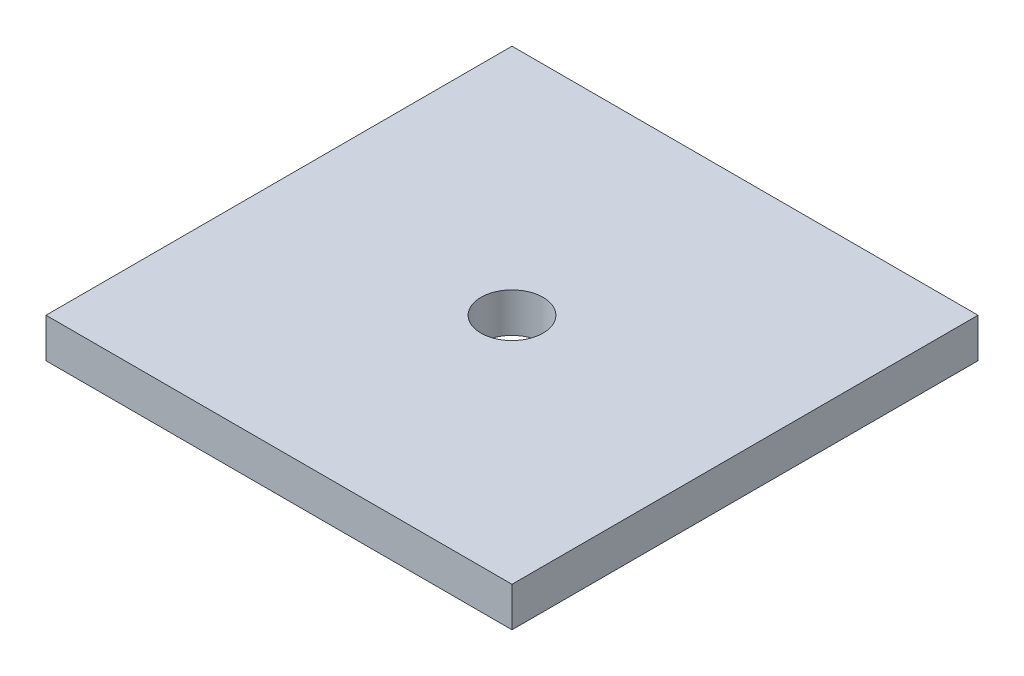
ISO-10303-21;
HEADER;
FILE_DESCRIPTION(('STEP AP214'),'2;1');
FILE_NAME('part.step','',(''),(''),'','','');
FILE_SCHEMA(('AUTOMOTIVE_DESIGN { 1 0 10303 214 1 1 1 1 }'));
ENDSEC;
DATA;
#1=APPLICATION_CONTEXT('core data for automotive mechanical design processes');
#2=APPLICATION_PROTOCOL_DEFINITION('international standard','automotive_design',2000,#1);
#3=PRODUCT_CONTEXT('',#1,'mechanical');
#4=PRODUCT('Part','Part','',(#3));
#5=PRODUCT_RELATED_PRODUCT_CATEGORY('part','',(#4));
#6=PRODUCT_DEFINITION_FORMATION('','',#4);
#7=PRODUCT_DEFINITION_CONTEXT('part definition',#1,'design');
#8=PRODUCT_DEFINITION('design','',#6,#7);
#9=PRODUCT_DEFINITION_SHAPE('','',#8);
#10=(LENGTH_UNIT() NAMED_UNIT(*) SI_UNIT(.MILLI.,.METRE.));
#11=(NAMED_UNIT(*) PLANE_ANGLE_UNIT() SI_UNIT($,.RADIAN.));
#12=(NAMED_UNIT(*) SI_UNIT($,.STERADIAN.) SOLID_ANGLE_UNIT());
#13=UNCERTAINTY_MEASURE_WITH_UNIT(LENGTH_MEASURE(1.E-05),#10,'distance_accuracy_value','');
#14=(GEOMETRIC_REPRESENTATION_CONTEXT(3) GLOBAL_UNCERTAINTY_ASSIGNED_CONTEXT((#13)) GLOBAL_UNIT_ASSIGNED_CONTEXT((#10,
#11,#12)) REPRESENTATION_CONTEXT('',''));
#15=CARTESIAN_POINT('',(0.,0.,0.));
#16=DIRECTION('',(0.,0.,1.));
#17=DIRECTION('',(1.,0.,0.));
#18=AXIS2_PLACEMENT_3D('',#15,#16,#17);
#19=CARTESIAN_POINT('',(37.5,6.35,-37.5));
#20=DIRECTION('',(-1.,0.,0.));
#21=DIRECTION('',(0.,0.,1.));
#22=AXIS2_PLACEMENT_3D('',#19,#20,#21);
#23=PLANE('',#22);
#24=DIRECTION('',(0.,0.,-1.));
#25=VECTOR('',#24,1.);
#26=CARTESIAN_POINT('',(37.5,0.,-37.5));
#27=LINE('',#26,#25);
#28=CARTESIAN_POINT('',(37.5,0.,37.5));
#29=VERTEX_POINT('',#28);
#30=CARTESIAN_POINT('',(37.5,0.,-37.5));
#31=VERTEX_POINT('',#30);
#32=EDGE_CURVE('E95',#29,#31,#27,.T.);
#33=ORIENTED_EDGE('',*,*,#32,.T.);
#34=DIRECTION('',(0.,-1.,0.));
#35=VECTOR('',#34,1.);
#36=CARTESIAN_POINT('',(37.5,6.35,-37.5));
#37=LINE('',#36,#35);
#38=CARTESIAN_POINT('',(37.5,6.35,-37.5));
#39=VERTEX_POINT('',#38);
#40=EDGE_CURVE('E11',#39,#31,#37,.T.);
#41=ORIENTED_EDGE('',*,*,#40,.F.);
#42=DIRECTION('',(0.,0.,-1.));
#43=VECTOR('',#42,1.);
#44=CARTESIAN_POINT('',(37.5,6.35,-37.5));
#45=LINE('',#44,#43);
#46=CARTESIAN_POINT('',(37.5,6.35,37.5));
#47=VERTEX_POINT('',#46);
#48=EDGE_CURVE('E83',#47,#39,#45,.T.);
#49=ORIENTED_EDGE('',*,*,#48,.F.);
#50=DIRECTION('',(0.,-1.,0.));
#51=VECTOR('',#50,1.);
#52=CARTESIAN_POINT('',(37.5,6.35,37.5));
#53=LINE('',#52,#51);
#54=EDGE_CURVE('E91',#47,#29,#53,.T.);
#55=ORIENTED_EDGE('',*,*,#54,.T.);
#56=EDGE_LOOP('',(#33,#41,#49,#55));
#57=FACE_BOUND('',#56,.T.);
#58=ADVANCED_FACE('F32',(#57),#23,.F.);
#59=CARTESIAN_POINT('',(-37.5,6.35,-37.5));
#60=DIRECTION('',(0.,0.,1.));
#61=DIRECTION('',(1.,0.,0.));
#62=AXIS2_PLACEMENT_3D('',#59,#60,#61);
#63=PLANE('',#62);
#64=DIRECTION('',(-1.,0.,0.));
#65=VECTOR('',#64,1.);
#66=CARTESIAN_POINT('',(-37.5,0.,-37.5));
#67=LINE('',#66,#65);
#68=CARTESIAN_POINT('',(-37.5,0.,-37.5));
#69=VERTEX_POINT('',#68);
#70=EDGE_CURVE('E87',#31,#69,#67,.T.);
#71=ORIENTED_EDGE('',*,*,#70,.T.);
#72=DIRECTION('',(0.,-1.,0.));
#73=VECTOR('',#72,1.);
#74=CARTESIAN_POINT('',(-37.5,6.35,-37.5));
#75=LINE('',#74,#73);
#76=CARTESIAN_POINT('',(-37.5,6.35,-37.5));
#77=VERTEX_POINT('',#76);
#78=EDGE_CURVE('E40',#77,#69,#75,.T.);
#79=ORIENTED_EDGE('',*,*,#78,.F.);
#80=DIRECTION('',(-1.,0.,0.));
#81=VECTOR('',#80,1.);
#82=CARTESIAN_POINT('',(-37.5,6.35,-37.5));
#83=LINE('',#82,#81);
#84=EDGE_CURVE('E78',#39,#77,#83,.T.);
#85=ORIENTED_EDGE('',*,*,#84,.F.);
#86=ORIENTED_EDGE('',*,*,#40,.T.);
#87=EDGE_LOOP('',(#71,#79,#85,#86));
#88=FACE_BOUND('',#87,.T.);
#89=ADVANCED_FACE('F86',(#88),#63,.F.);
#90=CARTESIAN_POINT('',(-37.5,6.35,-37.5));
#91=DIRECTION('',(1.,0.,0.));
#92=DIRECTION('',(0.,0.,-1.));
#93=AXIS2_PLACEMENT_3D('',#90,#91,#92);
#94=PLANE('',#93);
#95=DIRECTION('',(0.,0.,1.));
#96=VECTOR('',#95,1.);
#97=CARTESIAN_POINT('',(-37.5,0.,-37.5));
#98=LINE('',#97,#96);
#99=CARTESIAN_POINT('',(-37.5,0.,37.5));
#100=VERTEX_POINT('',#99);
#101=EDGE_CURVE('E65',#69,#100,#98,.T.);
#102=ORIENTED_EDGE('',*,*,#101,.T.);
#103=DIRECTION('',(0.,-1.,0.));
#104=VECTOR('',#103,1.);
#105=CARTESIAN_POINT('',(-37.5,6.35,37.5));
#106=LINE('',#105,#104);
#107=CARTESIAN_POINT('',(-37.5,6.35,37.5));
#108=VERTEX_POINT('',#107);
#109=EDGE_CURVE('E88',#108,#100,#106,.T.);
#110=ORIENTED_EDGE('',*,*,#109,.F.);
#111=DIRECTION('',(0.,0.,1.));
#112=VECTOR('',#111,1.);
#113=CARTESIAN_POINT('',(-37.5,6.35,-37.5));
#114=LINE('',#113,#112);
#115=EDGE_CURVE('E81',#77,#108,#114,.T.);
#116=ORIENTED_EDGE('',*,*,#115,.F.);
#117=ORIENTED_EDGE('',*,*,#78,.T.);
#118=EDGE_LOOP('',(#102,#110,#116,#117));
#119=FACE_BOUND('',#118,.T.);
#120=ADVANCED_FACE('F89',(#119),#94,.F.);
#121=CARTESIAN_POINT('',(-37.5,6.35,37.5));
#122=DIRECTION('',(0.,0.,-1.));
#123=DIRECTION('',(-1.,0.,0.));
#124=AXIS2_PLACEMENT_3D('',#121,#122,#123);
#125=PLANE('',#124);
#126=DIRECTION('',(1.,0.,0.));
#127=VECTOR('',#126,1.);
#128=CARTESIAN_POINT('',(-37.5,0.,37.5));
#129=LINE('',#128,#127);
#130=EDGE_CURVE('E71',#100,#29,#129,.T.);
#131=ORIENTED_EDGE('',*,*,#130,.T.);
#132=ORIENTED_EDGE('',*,*,#54,.F.);
#133=DIRECTION('',(1.,0.,0.));
#134=VECTOR('',#133,1.);
#135=CARTESIAN_POINT('',(-37.5,6.35,37.5));
#136=LINE('',#135,#134);
#137=EDGE_CURVE('E48',#108,#47,#136,.T.);
#138=ORIENTED_EDGE('',*,*,#137,.F.);
#139=ORIENTED_EDGE('',*,*,#109,.T.);
#140=EDGE_LOOP('',(#131,#132,#138,#139));
#141=FACE_BOUND('',#140,.T.);
#142=ADVANCED_FACE('F103',(#141),#125,.F.);
#143=CARTESIAN_POINT('',(37.5,6.35,37.5));
#144=DIRECTION('',(0.,1.,0.));
#145=DIRECTION('',(0.,0.,1.));
#146=AXIS2_PLACEMENT_3D('',#143,#144,#145);
#147=PLANE('',#146);
#148=CARTESIAN_POINT('',(0.,6.35,0.));
#149=DIRECTION('',(0.,1.,0.));
#150=DIRECTION('',(0.,0.,1.));
#151=AXIS2_PLACEMENT_3D('',#148,#149,#150);
#152=CIRCLE('',#151,4.99999999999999);
#153=CARTESIAN_POINT('',(0.,6.35,4.99999999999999));
#154=VERTEX_POINT('',#153);
#155=EDGE_CURVE('E111',#154,#154,#152,.T.);
#156=ORIENTED_EDGE('',*,*,#155,.F.);
#157=EDGE_LOOP('',(#156));
#158=FACE_BOUND('',#157,.T.);
#159=ORIENTED_EDGE('',*,*,#48,.T.);
#160=ORIENTED_EDGE('',*,*,#84,.T.);
#161=ORIENTED_EDGE('',*,*,#115,.T.);
#162=ORIENTED_EDGE('',*,*,#137,.T.);
#163=EDGE_LOOP('',(#159,#160,#161,#162));
#164=FACE_BOUND('',#163,.T.);
#165=ADVANCED_FACE('F79',(#158,#164),#147,.T.);
#166=CARTESIAN_POINT('',(37.5,0.,37.5));
#167=DIRECTION('',(0.,1.,0.));
#168=DIRECTION('',(0.,0.,1.));
#169=AXIS2_PLACEMENT_3D('',#166,#167,#168);
#170=PLANE('',#169);
#171=CARTESIAN_POINT('',(0.,0.,0.));
#172=DIRECTION('',(0.,1.,0.));
#173=DIRECTION('',(0.,0.,1.));
#174=AXIS2_PLACEMENT_3D('',#171,#172,#173);
#175=CIRCLE('',#174,5.);
#176=CARTESIAN_POINT('',(0.,0.,5.));
#177=VERTEX_POINT('',#176);
#178=EDGE_CURVE('E98',#177,#177,#175,.T.);
#179=ORIENTED_EDGE('',*,*,#178,.T.);
#180=EDGE_LOOP('',(#179));
#181=FACE_BOUND('',#180,.T.);
#182=ORIENTED_EDGE('',*,*,#32,.F.);
#183=ORIENTED_EDGE('',*,*,#130,.F.);
#184=ORIENTED_EDGE('',*,*,#101,.F.);
#185=ORIENTED_EDGE('',*,*,#70,.F.);
#186=EDGE_LOOP('',(#182,#183,#184,#185));
#187=FACE_BOUND('',#186,.T.);
#188=ADVANCED_FACE('F106',(#181,#187),#170,.F.);
#189=CARTESIAN_POINT('',(0.,6.35,0.));
#190=DIRECTION('',(0.,1.,0.));
#191=DIRECTION('',(0.,0.,1.));
#192=AXIS2_PLACEMENT_3D('',#189,#190,#191);
#193=CYLINDRICAL_SURFACE('',#192,4.99999999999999);
#194=ORIENTED_EDGE('',*,*,#178,.F.);
#195=EDGE_LOOP('',(#194));
#196=FACE_BOUND('',#195,.T.);
#197=ORIENTED_EDGE('',*,*,#155,.T.);
#198=EDGE_LOOP('',(#197));
#199=FACE_BOUND('',#198,.T.);
#200=ADVANCED_FACE('F115',(#196,#199),#193,.F.);
#201=CLOSED_SHELL('',(#58,#89,#120,#142,#165,#188,#200));
#202=MANIFOLD_SOLID_BREP('B2',#201);
#203=ADVANCED_BREP_SHAPE_REPRESENTATION('',(#18,#202),#14);
#204=SHAPE_DEFINITION_REPRESENTATION(#9,#203);
ENDSEC;
END-ISO-10303-21;
